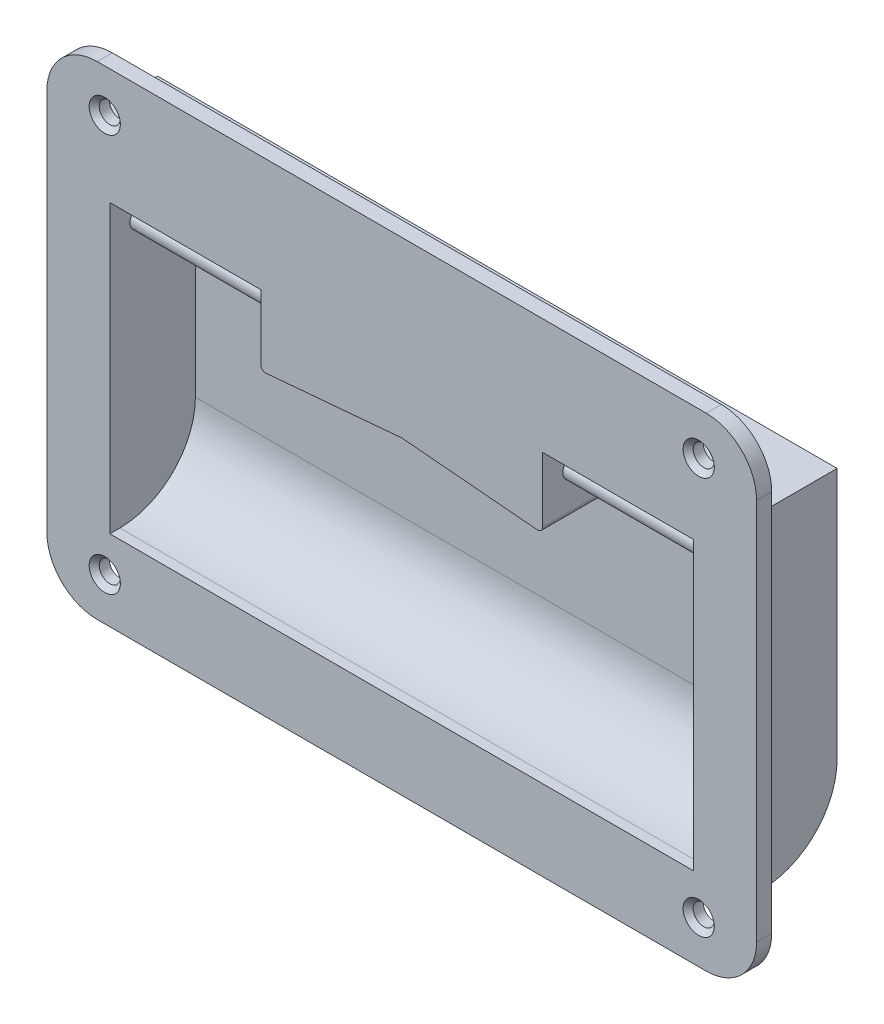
ISO-10303-21;
HEADER;
FILE_DESCRIPTION(('STEP AP214'),'2;1');
FILE_NAME('part.step','',(''),(''),'','','');
FILE_SCHEMA(('AUTOMOTIVE_DESIGN { 1 0 10303 214 1 1 1 1 }'));
ENDSEC;
DATA;
#1=APPLICATION_CONTEXT('core data for automotive mechanical design processes');
#2=APPLICATION_PROTOCOL_DEFINITION('international standard','automotive_design',2000,#1);
#3=PRODUCT_CONTEXT('',#1,'mechanical');
#4=PRODUCT('Part','Part','',(#3));
#5=PRODUCT_RELATED_PRODUCT_CATEGORY('part','',(#4));
#6=PRODUCT_DEFINITION_FORMATION('','',#4);
#7=PRODUCT_DEFINITION_CONTEXT('part definition',#1,'design');
#8=PRODUCT_DEFINITION('design','',#6,#7);
#9=PRODUCT_DEFINITION_SHAPE('','',#8);
#10=(LENGTH_UNIT() NAMED_UNIT(*) SI_UNIT(.MILLI.,.METRE.));
#11=(NAMED_UNIT(*) PLANE_ANGLE_UNIT() SI_UNIT($,.RADIAN.));
#12=(NAMED_UNIT(*) SI_UNIT($,.STERADIAN.) SOLID_ANGLE_UNIT());
#13=UNCERTAINTY_MEASURE_WITH_UNIT(LENGTH_MEASURE(1.E-05),#10,'distance_accuracy_value','');
#14=(GEOMETRIC_REPRESENTATION_CONTEXT(3) GLOBAL_UNCERTAINTY_ASSIGNED_CONTEXT((#13)) GLOBAL_UNIT_ASSIGNED_CONTEXT((#10,
#11,#12)) REPRESENTATION_CONTEXT('',''));
#15=CARTESIAN_POINT('',(0.,0.,0.));
#16=DIRECTION('',(0.,0.,1.));
#17=DIRECTION('',(1.,0.,0.));
#18=AXIS2_PLACEMENT_3D('',#15,#16,#17);
#19=CARTESIAN_POINT('',(-11.5,77.5,3.));
#20=DIRECTION('',(1.,0.,0.));
#21=DIRECTION('',(0.,0.,-1.));
#22=AXIS2_PLACEMENT_3D('',#19,#20,#21);
#23=PLANE('',#22);
#24=DIRECTION('',(0.,-1.,0.));
#25=VECTOR('',#24,1.);
#26=CARTESIAN_POINT('',(-11.5,77.5,0.));
#27=LINE('',#26,#25);
#28=CARTESIAN_POINT('',(-11.5,77.5,0.));
#29=VERTEX_POINT('',#28);
#30=CARTESIAN_POINT('',(-11.5,1.5,0.));
#31=VERTEX_POINT('',#30);
#32=EDGE_CURVE('E361',#29,#31,#27,.T.);
#33=ORIENTED_EDGE('',*,*,#32,.T.);
#34=DIRECTION('',(0.,0.,-1.));
#35=VECTOR('',#34,1.);
#36=CARTESIAN_POINT('',(-11.5,1.5,3.));
#37=LINE('',#36,#35);
#38=CARTESIAN_POINT('',(-11.5,1.5,3.));
#39=VERTEX_POINT('',#38);
#40=EDGE_CURVE('E9',#39,#31,#37,.T.);
#41=ORIENTED_EDGE('',*,*,#40,.F.);
#42=DIRECTION('',(0.,-1.,0.));
#43=VECTOR('',#42,1.);
#44=CARTESIAN_POINT('',(-11.5,77.5,3.));
#45=LINE('',#44,#43);
#46=CARTESIAN_POINT('',(-11.5,77.5,3.));
#47=VERTEX_POINT('',#46);
#48=EDGE_CURVE('E362',#47,#39,#45,.T.);
#49=ORIENTED_EDGE('',*,*,#48,.F.);
#50=DIRECTION('',(0.,0.,-1.));
#51=VECTOR('',#50,1.);
#52=CARTESIAN_POINT('',(-11.5,77.5,3.));
#53=LINE('',#52,#51);
#54=EDGE_CURVE('E380',#47,#29,#53,.T.);
#55=ORIENTED_EDGE('',*,*,#54,.T.);
#56=EDGE_LOOP('',(#33,#41,#49,#55));
#57=FACE_BOUND('',#56,.T.);
#58=ADVANCED_FACE('F14',(#57),#23,.F.);
#59=CARTESIAN_POINT('',(-1.5,1.5,3.));
#60=DIRECTION('',(0.,0.,-1.));
#61=DIRECTION('',(-1.,0.,0.));
#62=AXIS2_PLACEMENT_3D('',#59,#60,#61);
#63=CYLINDRICAL_SURFACE('',#62,10.);
#64=CARTESIAN_POINT('',(-1.5,1.5,0.));
#65=DIRECTION('',(0.,0.,1.));
#66=DIRECTION('',(1.,0.,0.));
#67=AXIS2_PLACEMENT_3D('',#64,#65,#66);
#68=CIRCLE('',#67,10.);
#69=CARTESIAN_POINT('',(-1.5,-8.5,0.));
#70=VERTEX_POINT('',#69);
#71=EDGE_CURVE('E383',#31,#70,#68,.T.);
#72=ORIENTED_EDGE('',*,*,#71,.T.);
#73=DIRECTION('',(0.,0.,-1.));
#74=VECTOR('',#73,1.);
#75=CARTESIAN_POINT('',(-1.5,-8.5,3.));
#76=LINE('',#75,#74);
#77=CARTESIAN_POINT('',(-1.5,-8.5,3.));
#78=VERTEX_POINT('',#77);
#79=EDGE_CURVE('E22',#78,#70,#76,.T.);
#80=ORIENTED_EDGE('',*,*,#79,.F.);
#81=CARTESIAN_POINT('',(-1.5,1.5,3.));
#82=DIRECTION('',(0.,0.,1.));
#83=DIRECTION('',(1.,0.,0.));
#84=AXIS2_PLACEMENT_3D('',#81,#82,#83);
#85=CIRCLE('',#84,10.);
#86=EDGE_CURVE('E365',#39,#78,#85,.T.);
#87=ORIENTED_EDGE('',*,*,#86,.F.);
#88=ORIENTED_EDGE('',*,*,#40,.T.);
#89=EDGE_LOOP('',(#72,#80,#87,#88));
#90=FACE_BOUND('',#89,.T.);
#91=ADVANCED_FACE('F440',(#90),#63,.T.);
#92=CARTESIAN_POINT('',(-1.5,-8.5,3.));
#93=DIRECTION('',(0.,1.,0.));
#94=DIRECTION('',(0.,0.,1.));
#95=AXIS2_PLACEMENT_3D('',#92,#93,#94);
#96=PLANE('',#95);
#97=DIRECTION('',(1.,0.,0.));
#98=VECTOR('',#97,1.);
#99=CARTESIAN_POINT('',(-1.5,-8.5,0.));
#100=LINE('',#99,#98);
#101=CARTESIAN_POINT('',(119.5,-8.5,0.));
#102=VERTEX_POINT('',#101);
#103=EDGE_CURVE('E385',#70,#102,#100,.T.);
#104=ORIENTED_EDGE('',*,*,#103,.T.);
#105=DIRECTION('',(0.,0.,-1.));
#106=VECTOR('',#105,1.);
#107=CARTESIAN_POINT('',(119.5,-8.5,3.));
#108=LINE('',#107,#106);
#109=CARTESIAN_POINT('',(119.5,-8.5,3.));
#110=VERTEX_POINT('',#109);
#111=EDGE_CURVE('E410',#110,#102,#108,.T.);
#112=ORIENTED_EDGE('',*,*,#111,.F.);
#113=DIRECTION('',(1.,0.,0.));
#114=VECTOR('',#113,1.);
#115=CARTESIAN_POINT('',(-1.5,-8.5,3.));
#116=LINE('',#115,#114);
#117=EDGE_CURVE('E368',#78,#110,#116,.T.);
#118=ORIENTED_EDGE('',*,*,#117,.F.);
#119=ORIENTED_EDGE('',*,*,#79,.T.);
#120=EDGE_LOOP('',(#104,#112,#118,#119));
#121=FACE_BOUND('',#120,.T.);
#122=ADVANCED_FACE('F418',(#121),#96,.F.);
#123=CARTESIAN_POINT('',(119.5,1.5,3.));
#124=DIRECTION('',(0.,0.,-1.));
#125=DIRECTION('',(-1.,0.,0.));
#126=AXIS2_PLACEMENT_3D('',#123,#124,#125);
#127=CYLINDRICAL_SURFACE('',#126,10.);
#128=CARTESIAN_POINT('',(119.5,1.5,0.));
#129=DIRECTION('',(0.,0.,1.));
#130=DIRECTION('',(1.,0.,0.));
#131=AXIS2_PLACEMENT_3D('',#128,#129,#130);
#132=CIRCLE('',#131,10.);
#133=CARTESIAN_POINT('',(129.5,1.5,0.));
#134=VERTEX_POINT('',#133);
#135=EDGE_CURVE('E387',#102,#134,#132,.T.);
#136=ORIENTED_EDGE('',*,*,#135,.T.);
#137=DIRECTION('',(0.,0.,-1.));
#138=VECTOR('',#137,1.);
#139=CARTESIAN_POINT('',(129.5,1.5,3.));
#140=LINE('',#139,#138);
#141=CARTESIAN_POINT('',(129.5,1.5,3.));
#142=VERTEX_POINT('',#141);
#143=EDGE_CURVE('E407',#142,#134,#140,.T.);
#144=ORIENTED_EDGE('',*,*,#143,.F.);
#145=CARTESIAN_POINT('',(119.5,1.5,3.));
#146=DIRECTION('',(0.,0.,1.));
#147=DIRECTION('',(1.,0.,0.));
#148=AXIS2_PLACEMENT_3D('',#145,#146,#147);
#149=CIRCLE('',#148,10.);
#150=EDGE_CURVE('E370',#110,#142,#149,.T.);
#151=ORIENTED_EDGE('',*,*,#150,.F.);
#152=ORIENTED_EDGE('',*,*,#111,.T.);
#153=EDGE_LOOP('',(#136,#144,#151,#152));
#154=FACE_BOUND('',#153,.T.);
#155=ADVANCED_FACE('F429',(#154),#127,.T.);
#156=CARTESIAN_POINT('',(129.5,1.5,3.));
#157=DIRECTION('',(-1.,0.,0.));
#158=DIRECTION('',(0.,0.,1.));
#159=AXIS2_PLACEMENT_3D('',#156,#157,#158);
#160=PLANE('',#159);
#161=DIRECTION('',(0.,1.,0.));
#162=VECTOR('',#161,1.);
#163=CARTESIAN_POINT('',(129.5,1.5,0.));
#164=LINE('',#163,#162);
#165=CARTESIAN_POINT('',(129.5,77.5,0.));
#166=VERTEX_POINT('',#165);
#167=EDGE_CURVE('E389',#134,#166,#164,.T.);
#168=ORIENTED_EDGE('',*,*,#167,.T.);
#169=DIRECTION('',(0.,0.,-1.));
#170=VECTOR('',#169,1.);
#171=CARTESIAN_POINT('',(129.5,77.5,3.));
#172=LINE('',#171,#170);
#173=CARTESIAN_POINT('',(129.5,77.5,3.));
#174=VERTEX_POINT('',#173);
#175=EDGE_CURVE('E404',#174,#166,#172,.T.);
#176=ORIENTED_EDGE('',*,*,#175,.F.);
#177=DIRECTION('',(0.,1.,0.));
#178=VECTOR('',#177,1.);
#179=CARTESIAN_POINT('',(129.5,1.5,3.));
#180=LINE('',#179,#178);
#181=EDGE_CURVE('E372',#142,#174,#180,.T.);
#182=ORIENTED_EDGE('',*,*,#181,.F.);
#183=ORIENTED_EDGE('',*,*,#143,.T.);
#184=EDGE_LOOP('',(#168,#176,#182,#183));
#185=FACE_BOUND('',#184,.T.);
#186=ADVANCED_FACE('F433',(#185),#160,.F.);
#187=CARTESIAN_POINT('',(119.5,77.5,3.));
#188=DIRECTION('',(0.,0.,-1.));
#189=DIRECTION('',(-1.,0.,0.));
#190=AXIS2_PLACEMENT_3D('',#187,#188,#189);
#191=CYLINDRICAL_SURFACE('',#190,10.);
#192=CARTESIAN_POINT('',(119.5,77.5,0.));
#193=DIRECTION('',(0.,0.,1.));
#194=DIRECTION('',(1.,0.,0.));
#195=AXIS2_PLACEMENT_3D('',#192,#193,#194);
#196=CIRCLE('',#195,10.);
#197=CARTESIAN_POINT('',(119.5,87.5,0.));
#198=VERTEX_POINT('',#197);
#199=EDGE_CURVE('E391',#166,#198,#196,.T.);
#200=ORIENTED_EDGE('',*,*,#199,.T.);
#201=DIRECTION('',(0.,0.,-1.));
#202=VECTOR('',#201,1.);
#203=CARTESIAN_POINT('',(119.5,87.5,3.));
#204=LINE('',#203,#202);
#205=CARTESIAN_POINT('',(119.5,87.5,3.));
#206=VERTEX_POINT('',#205);
#207=EDGE_CURVE('E401',#206,#198,#204,.T.);
#208=ORIENTED_EDGE('',*,*,#207,.F.);
#209=CARTESIAN_POINT('',(119.5,77.5,3.));
#210=DIRECTION('',(0.,0.,1.));
#211=DIRECTION('',(1.,0.,0.));
#212=AXIS2_PLACEMENT_3D('',#209,#210,#211);
#213=CIRCLE('',#212,10.);
#214=EDGE_CURVE('E374',#174,#206,#213,.T.);
#215=ORIENTED_EDGE('',*,*,#214,.F.);
#216=ORIENTED_EDGE('',*,*,#175,.T.);
#217=EDGE_LOOP('',(#200,#208,#215,#216));
#218=FACE_BOUND('',#217,.T.);
#219=ADVANCED_FACE('F453',(#218),#191,.T.);
#220=CARTESIAN_POINT('',(119.5,87.5,3.));
#221=DIRECTION('',(0.,-1.,0.));
#222=DIRECTION('',(0.,0.,-1.));
#223=AXIS2_PLACEMENT_3D('',#220,#221,#222);
#224=PLANE('',#223);
#225=DIRECTION('',(-1.,0.,0.));
#226=VECTOR('',#225,1.);
#227=CARTESIAN_POINT('',(119.5,87.5,0.));
#228=LINE('',#227,#226);
#229=CARTESIAN_POINT('',(-1.5,87.5,0.));
#230=VERTEX_POINT('',#229);
#231=EDGE_CURVE('E393',#198,#230,#228,.T.);
#232=ORIENTED_EDGE('',*,*,#231,.T.);
#233=DIRECTION('',(0.,0.,-1.));
#234=VECTOR('',#233,1.);
#235=CARTESIAN_POINT('',(-1.5,87.5,3.));
#236=LINE('',#235,#234);
#237=CARTESIAN_POINT('',(-1.5,87.5,3.));
#238=VERTEX_POINT('',#237);
#239=EDGE_CURVE('E398',#238,#230,#236,.T.);
#240=ORIENTED_EDGE('',*,*,#239,.F.);
#241=DIRECTION('',(-1.,0.,0.));
#242=VECTOR('',#241,1.);
#243=CARTESIAN_POINT('',(119.5,87.5,3.));
#244=LINE('',#243,#242);
#245=EDGE_CURVE('E376',#206,#238,#244,.T.);
#246=ORIENTED_EDGE('',*,*,#245,.F.);
#247=ORIENTED_EDGE('',*,*,#207,.T.);
#248=EDGE_LOOP('',(#232,#240,#246,#247));
#249=FACE_BOUND('',#248,.T.);
#250=ADVANCED_FACE('F451',(#249),#224,.F.);
#251=CARTESIAN_POINT('',(-1.5,77.5,3.));
#252=DIRECTION('',(0.,0.,-1.));
#253=DIRECTION('',(-1.,0.,0.));
#254=AXIS2_PLACEMENT_3D('',#251,#252,#253);
#255=CYLINDRICAL_SURFACE('',#254,10.);
#256=CARTESIAN_POINT('',(-1.5,77.5,0.));
#257=DIRECTION('',(0.,0.,1.));
#258=DIRECTION('',(1.,0.,0.));
#259=AXIS2_PLACEMENT_3D('',#256,#257,#258);
#260=CIRCLE('',#259,10.);
#261=EDGE_CURVE('E366',#230,#29,#260,.T.);
#262=ORIENTED_EDGE('',*,*,#261,.T.);
#263=ORIENTED_EDGE('',*,*,#54,.F.);
#264=CARTESIAN_POINT('',(-1.5,77.5,3.));
#265=DIRECTION('',(0.,0.,1.));
#266=DIRECTION('',(1.,0.,0.));
#267=AXIS2_PLACEMENT_3D('',#264,#265,#266);
#268=CIRCLE('',#267,10.);
#269=EDGE_CURVE('E378',#238,#47,#268,.T.);
#270=ORIENTED_EDGE('',*,*,#269,.F.);
#271=ORIENTED_EDGE('',*,*,#239,.T.);
#272=EDGE_LOOP('',(#262,#263,#270,#271));
#273=FACE_BOUND('',#272,.T.);
#274=ADVANCED_FACE('F446',(#273),#255,.T.);
#275=CARTESIAN_POINT('',(-1.5,1.5,3.));
#276=DIRECTION('',(0.,0.,1.));
#277=DIRECTION('',(1.,0.,0.));
#278=AXIS2_PLACEMENT_3D('',#275,#276,#277);
#279=PLANE('',#278);
#280=DIRECTION('',(0.,1.,0.));
#281=VECTOR('',#280,1.);
#282=CARTESIAN_POINT('',(117.,24.,3.));
#283=LINE('',#282,#281);
#284=CARTESIAN_POINT('',(117.,7.5,3.));
#285=VERTEX_POINT('',#284);
#286=CARTESIAN_POINT('',(117.,64.5,3.));
#287=VERTEX_POINT('',#286);
#288=EDGE_CURVE('E182',#285,#287,#283,.T.);
#289=ORIENTED_EDGE('',*,*,#288,.F.);
#290=DIRECTION('',(-1.,0.,0.));
#291=VECTOR('',#290,1.);
#292=CARTESIAN_POINT('',(117.,7.5,3.));
#293=LINE('',#292,#291);
#294=CARTESIAN_POINT('',(1.,7.5,3.));
#295=VERTEX_POINT('',#294);
#296=EDGE_CURVE('E187',#285,#295,#293,.T.);
#297=ORIENTED_EDGE('',*,*,#296,.T.);
#298=DIRECTION('',(0.,-1.,0.));
#299=VECTOR('',#298,1.);
#300=CARTESIAN_POINT('',(1.,64.5,3.));
#301=LINE('',#300,#299);
#302=CARTESIAN_POINT('',(1.,64.5,3.));
#303=VERTEX_POINT('',#302);
#304=EDGE_CURVE('E193',#303,#295,#301,.T.);
#305=ORIENTED_EDGE('',*,*,#304,.F.);
#306=DIRECTION('',(-1.,0.,0.));
#307=VECTOR('',#306,1.);
#308=CARTESIAN_POINT('',(31.,64.5,3.));
#309=LINE('',#308,#307);
#310=CARTESIAN_POINT('',(31.,64.5,3.));
#311=VERTEX_POINT('',#310);
#312=EDGE_CURVE('E225',#311,#303,#309,.T.);
#313=ORIENTED_EDGE('',*,*,#312,.F.);
#314=DIRECTION('',(0.,1.,0.));
#315=VECTOR('',#314,1.);
#316=CARTESIAN_POINT('',(31.,51.6416259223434,3.));
#317=LINE('',#316,#315);
#318=CARTESIAN_POINT('',(31.,51.6416259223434,3.));
#319=VERTEX_POINT('',#318);
#320=EDGE_CURVE('E29',#319,#311,#317,.T.);
#321=ORIENTED_EDGE('',*,*,#320,.F.);
#322=CARTESIAN_POINT('',(32.,51.6416259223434,3.));
#323=DIRECTION('',(0.,0.,1.));
#324=DIRECTION('',(1.,0.,0.));
#325=AXIS2_PLACEMENT_3D('',#322,#323,#324);
#326=CIRCLE('',#325,1.);
#327=CARTESIAN_POINT('',(32.0871557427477,50.6454312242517,3.));
#328=VERTEX_POINT('',#327);
#329=EDGE_CURVE('E267',#319,#328,#326,.T.);
#330=ORIENTED_EDGE('',*,*,#329,.T.);
#331=DIRECTION('',(-0.996194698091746,-0.0871557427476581,0.));
#332=VECTOR('',#331,1.);
#333=CARTESIAN_POINT('',(59.,53.,3.));
#334=LINE('',#333,#332);
#335=CARTESIAN_POINT('',(59.,53.,3.));
#336=VERTEX_POINT('',#335);
#337=EDGE_CURVE('E264',#336,#328,#334,.T.);
#338=ORIENTED_EDGE('',*,*,#337,.F.);
#339=DIRECTION('',(-0.996194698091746,0.0871557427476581,0.));
#340=VECTOR('',#339,1.);
#341=CARTESIAN_POINT('',(85.9128442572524,50.6454312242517,3.));
#342=LINE('',#341,#340);
#343=CARTESIAN_POINT('',(85.9128442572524,50.6454312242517,3.));
#344=VERTEX_POINT('',#343);
#345=EDGE_CURVE('E261',#344,#336,#342,.T.);
#346=ORIENTED_EDGE('',*,*,#345,.F.);
#347=CARTESIAN_POINT('',(86.,51.6416259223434,3.));
#348=DIRECTION('',(0.,0.,1.));
#349=DIRECTION('',(1.,0.,0.));
#350=AXIS2_PLACEMENT_3D('',#347,#348,#349);
#351=CIRCLE('',#350,1.);
#352=CARTESIAN_POINT('',(87.,51.6416259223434,3.));
#353=VERTEX_POINT('',#352);
#354=EDGE_CURVE('E258',#344,#353,#351,.T.);
#355=ORIENTED_EDGE('',*,*,#354,.T.);
#356=DIRECTION('',(0.,-1.,0.));
#357=VECTOR('',#356,1.);
#358=CARTESIAN_POINT('',(87.,64.5,3.));
#359=LINE('',#358,#357);
#360=CARTESIAN_POINT('',(87.,64.5,3.));
#361=VERTEX_POINT('',#360);
#362=EDGE_CURVE('E255',#361,#353,#359,.T.);
#363=ORIENTED_EDGE('',*,*,#362,.F.);
#364=DIRECTION('',(-1.,0.,0.));
#365=VECTOR('',#364,1.);
#366=CARTESIAN_POINT('',(117.,64.5,3.));
#367=LINE('',#366,#365);
#368=EDGE_CURVE('E190',#287,#361,#367,.T.);
#369=ORIENTED_EDGE('',*,*,#368,.F.);
#370=EDGE_LOOP('',(#289,#297,#305,#313,#321,#330,#338,#346,#355,#363,#369));
#371=FACE_BOUND('',#370,.T.);
#372=CARTESIAN_POINT('',(0.,0.,3.));
#373=DIRECTION('',(0.,0.,-1.));
#374=DIRECTION('',(-1.,0.,0.));
#375=AXIS2_PLACEMENT_3D('',#372,#373,#374);
#376=CIRCLE('',#375,3.1);
#377=CARTESIAN_POINT('',(-3.1,0.,3.));
#378=VERTEX_POINT('',#377);
#379=EDGE_CURVE('E296',#378,#378,#376,.T.);
#380=ORIENTED_EDGE('',*,*,#379,.T.);
#381=EDGE_LOOP('',(#380));
#382=FACE_BOUND('',#381,.T.);
#383=CARTESIAN_POINT('',(0.,79.,3.));
#384=DIRECTION('',(0.,0.,-1.));
#385=DIRECTION('',(-1.,0.,0.));
#386=AXIS2_PLACEMENT_3D('',#383,#384,#385);
#387=CIRCLE('',#386,3.1);
#388=CARTESIAN_POINT('',(-3.1,79.,3.));
#389=VERTEX_POINT('',#388);
#390=EDGE_CURVE('E305',#389,#389,#387,.T.);
#391=ORIENTED_EDGE('',*,*,#390,.T.);
#392=EDGE_LOOP('',(#391));
#393=FACE_BOUND('',#392,.T.);
#394=CARTESIAN_POINT('',(118.,0.,3.));
#395=DIRECTION('',(0.,0.,-1.));
#396=DIRECTION('',(-1.,0.,0.));
#397=AXIS2_PLACEMENT_3D('',#394,#395,#396);
#398=CIRCLE('',#397,3.1);
#399=CARTESIAN_POINT('',(114.9,0.,3.));
#400=VERTEX_POINT('',#399);
#401=EDGE_CURVE('E314',#400,#400,#398,.T.);
#402=ORIENTED_EDGE('',*,*,#401,.T.);
#403=EDGE_LOOP('',(#402));
#404=FACE_BOUND('',#403,.T.);
#405=CARTESIAN_POINT('',(118.,79.,3.));
#406=DIRECTION('',(0.,0.,-1.));
#407=DIRECTION('',(-1.,0.,0.));
#408=AXIS2_PLACEMENT_3D('',#405,#406,#407);
#409=CIRCLE('',#408,3.1);
#410=CARTESIAN_POINT('',(114.9,79.,3.));
#411=VERTEX_POINT('',#410);
#412=EDGE_CURVE('E323',#411,#411,#409,.T.);
#413=ORIENTED_EDGE('',*,*,#412,.T.);
#414=EDGE_LOOP('',(#413));
#415=FACE_BOUND('',#414,.T.);
#416=ORIENTED_EDGE('',*,*,#48,.T.);
#417=ORIENTED_EDGE('',*,*,#86,.T.);
#418=ORIENTED_EDGE('',*,*,#117,.T.);
#419=ORIENTED_EDGE('',*,*,#150,.T.);
#420=ORIENTED_EDGE('',*,*,#181,.T.);
#421=ORIENTED_EDGE('',*,*,#214,.T.);
#422=ORIENTED_EDGE('',*,*,#245,.T.);
#423=ORIENTED_EDGE('',*,*,#269,.T.);
#424=EDGE_LOOP('',(#416,#417,#418,#419,#420,#421,#422,#423));
#425=FACE_BOUND('',#424,.T.);
#426=ADVANCED_FACE('F184',(#371,#382,#393,#404,#415,#425),#279,.T.);
#427=CARTESIAN_POINT('',(-1.5,1.5,0.));
#428=DIRECTION('',(0.,0.,1.));
#429=DIRECTION('',(1.,0.,0.));
#430=AXIS2_PLACEMENT_3D('',#427,#428,#429);
#431=PLANE('',#430);
#432=CARTESIAN_POINT('',(0.,0.,0.));
#433=DIRECTION('',(0.,0.,-1.));
#434=DIRECTION('',(-1.,0.,0.));
#435=AXIS2_PLACEMENT_3D('',#432,#433,#434);
#436=CIRCLE('',#435,2.1);
#437=CARTESIAN_POINT('',(-2.1,0.,0.));
#438=VERTEX_POINT('',#437);
#439=EDGE_CURVE('E290',#438,#438,#436,.T.);
#440=ORIENTED_EDGE('',*,*,#439,.F.);
#441=EDGE_LOOP('',(#440));
#442=FACE_BOUND('',#441,.T.);
#443=CARTESIAN_POINT('',(0.,79.,0.));
#444=DIRECTION('',(0.,0.,-1.));
#445=DIRECTION('',(-1.,0.,0.));
#446=AXIS2_PLACEMENT_3D('',#443,#444,#445);
#447=CIRCLE('',#446,2.1);
#448=CARTESIAN_POINT('',(-2.1,79.,0.));
#449=VERTEX_POINT('',#448);
#450=EDGE_CURVE('E299',#449,#449,#447,.T.);
#451=ORIENTED_EDGE('',*,*,#450,.F.);
#452=EDGE_LOOP('',(#451));
#453=FACE_BOUND('',#452,.T.);
#454=CARTESIAN_POINT('',(118.,0.,0.));
#455=DIRECTION('',(0.,0.,-1.));
#456=DIRECTION('',(-1.,0.,0.));
#457=AXIS2_PLACEMENT_3D('',#454,#455,#456);
#458=CIRCLE('',#457,2.1);
#459=CARTESIAN_POINT('',(115.9,0.,0.));
#460=VERTEX_POINT('',#459);
#461=EDGE_CURVE('E308',#460,#460,#458,.T.);
#462=ORIENTED_EDGE('',*,*,#461,.F.);
#463=EDGE_LOOP('',(#462));
#464=FACE_BOUND('',#463,.T.);
#465=CARTESIAN_POINT('',(118.,79.,0.));
#466=DIRECTION('',(0.,0.,-1.));
#467=DIRECTION('',(-1.,0.,0.));
#468=AXIS2_PLACEMENT_3D('',#465,#466,#467);
#469=CIRCLE('',#468,2.1);
#470=CARTESIAN_POINT('',(115.9,79.,0.));
#471=VERTEX_POINT('',#470);
#472=EDGE_CURVE('E317',#471,#471,#469,.T.);
#473=ORIENTED_EDGE('',*,*,#472,.F.);
#474=EDGE_LOOP('',(#473));
#475=FACE_BOUND('',#474,.T.);
#476=DIRECTION('',(-1.,0.,0.));
#477=VECTOR('',#476,1.);
#478=CARTESIAN_POINT('',(126.5,7.,0.));
#479=LINE('',#478,#477);
#480=CARTESIAN_POINT('',(126.5,7.,0.));
#481=VERTEX_POINT('',#480);
#482=CARTESIAN_POINT('',(-8.5,7.,0.));
#483=VERTEX_POINT('',#482);
#484=EDGE_CURVE('E37',#481,#483,#479,.T.);
#485=ORIENTED_EDGE('',*,*,#484,.F.);
#486=DIRECTION('',(0.,-1.,0.));
#487=VECTOR('',#486,1.);
#488=CARTESIAN_POINT('',(126.5,72.,0.));
#489=LINE('',#488,#487);
#490=CARTESIAN_POINT('',(126.5,72.,0.));
#491=VERTEX_POINT('',#490);
#492=EDGE_CURVE('E327',#491,#481,#489,.T.);
#493=ORIENTED_EDGE('',*,*,#492,.F.);
#494=DIRECTION('',(-1.,0.,0.));
#495=VECTOR('',#494,1.);
#496=CARTESIAN_POINT('',(126.5,72.,0.));
#497=LINE('',#496,#495);
#498=CARTESIAN_POINT('',(-8.5,72.,0.));
#499=VERTEX_POINT('',#498);
#500=EDGE_CURVE('E340',#491,#499,#497,.T.);
#501=ORIENTED_EDGE('',*,*,#500,.T.);
#502=DIRECTION('',(0.,-1.,0.));
#503=VECTOR('',#502,1.);
#504=CARTESIAN_POINT('',(-8.5,72.,0.));
#505=LINE('',#504,#503);
#506=EDGE_CURVE('E326',#499,#483,#505,.T.);
#507=ORIENTED_EDGE('',*,*,#506,.T.);
#508=EDGE_LOOP('',(#485,#493,#501,#507));
#509=FACE_BOUND('',#508,.T.);
#510=ORIENTED_EDGE('',*,*,#32,.F.);
#511=ORIENTED_EDGE('',*,*,#261,.F.);
#512=ORIENTED_EDGE('',*,*,#231,.F.);
#513=ORIENTED_EDGE('',*,*,#199,.F.);
#514=ORIENTED_EDGE('',*,*,#167,.F.);
#515=ORIENTED_EDGE('',*,*,#135,.F.);
#516=ORIENTED_EDGE('',*,*,#103,.F.);
#517=ORIENTED_EDGE('',*,*,#71,.F.);
#518=EDGE_LOOP('',(#510,#511,#512,#513,#514,#515,#516,#517));
#519=FACE_BOUND('',#518,.T.);
#520=ADVANCED_FACE('F424',(#442,#453,#464,#475,#509,#519),#431,.F.);
#521=CARTESIAN_POINT('',(126.5,7.,0.));
#522=DIRECTION('',(0.,1.,0.));
#523=DIRECTION('',(0.,0.,1.));
#524=AXIS2_PLACEMENT_3D('',#521,#522,#523);
#525=PLANE('',#524);
#526=DIRECTION('',(0.,0.,-1.));
#527=VECTOR('',#526,1.);
#528=CARTESIAN_POINT('',(-8.5,7.,0.));
#529=LINE('',#528,#527);
#530=CARTESIAN_POINT('',(-8.5,7.,-1.));
#531=VERTEX_POINT('',#530);
#532=EDGE_CURVE('E342',#483,#531,#529,.T.);
#533=ORIENTED_EDGE('',*,*,#532,.T.);
#534=DIRECTION('',(-1.,0.,0.));
#535=VECTOR('',#534,1.);
#536=CARTESIAN_POINT('',(126.5,7.,-1.));
#537=LINE('',#536,#535);
#538=CARTESIAN_POINT('',(126.5,7.,-1.));
#539=VERTEX_POINT('',#538);
#540=EDGE_CURVE('E357',#539,#531,#537,.T.);
#541=ORIENTED_EDGE('',*,*,#540,.F.);
#542=DIRECTION('',(0.,0.,-1.));
#543=VECTOR('',#542,1.);
#544=CARTESIAN_POINT('',(126.5,7.,0.));
#545=LINE('',#544,#543);
#546=EDGE_CURVE('E330',#481,#539,#545,.T.);
#547=ORIENTED_EDGE('',*,*,#546,.F.);
#548=ORIENTED_EDGE('',*,*,#484,.T.);
#549=EDGE_LOOP('',(#533,#541,#547,#548));
#550=FACE_BOUND('',#549,.T.);
#551=ADVANCED_FACE('F535',(#550),#525,.F.);
#552=CARTESIAN_POINT('',(126.5,22.,-1.));
#553=DIRECTION('',(-1.,0.,0.));
#554=DIRECTION('',(0.,0.,1.));
#555=AXIS2_PLACEMENT_3D('',#552,#553,#554);
#556=CYLINDRICAL_SURFACE('',#555,15.);
#557=CARTESIAN_POINT('',(-8.5,22.,-1.));
#558=DIRECTION('',(1.,0.,0.));
#559=DIRECTION('',(0.,0.,-1.));
#560=AXIS2_PLACEMENT_3D('',#557,#558,#559);
#561=CIRCLE('',#560,15.);
#562=CARTESIAN_POINT('',(-8.5,22.,-16.));
#563=VERTEX_POINT('',#562);
#564=EDGE_CURVE('E344',#531,#563,#561,.T.);
#565=ORIENTED_EDGE('',*,*,#564,.T.);
#566=DIRECTION('',(-1.,0.,0.));
#567=VECTOR('',#566,1.);
#568=CARTESIAN_POINT('',(126.5,22.,-16.));
#569=LINE('',#568,#567);
#570=CARTESIAN_POINT('',(126.5,22.,-16.));
#571=VERTEX_POINT('',#570);
#572=EDGE_CURVE('E354',#571,#563,#569,.T.);
#573=ORIENTED_EDGE('',*,*,#572,.F.);
#574=CARTESIAN_POINT('',(126.5,22.,-1.));
#575=DIRECTION('',(1.,0.,0.));
#576=DIRECTION('',(0.,0.,-1.));
#577=AXIS2_PLACEMENT_3D('',#574,#575,#576);
#578=CIRCLE('',#577,15.);
#579=EDGE_CURVE('E333',#539,#571,#578,.T.);
#580=ORIENTED_EDGE('',*,*,#579,.F.);
#581=ORIENTED_EDGE('',*,*,#540,.T.);
#582=EDGE_LOOP('',(#565,#573,#580,#581));
#583=FACE_BOUND('',#582,.T.);
#584=ADVANCED_FACE('F544',(#583),#556,.T.);
#585=CARTESIAN_POINT('',(126.5,22.,-16.));
#586=DIRECTION('',(0.,0.,1.));
#587=DIRECTION('',(1.,0.,0.));
#588=AXIS2_PLACEMENT_3D('',#585,#586,#587);
#589=PLANE('',#588);
#590=DIRECTION('',(0.,1.,0.));
#591=VECTOR('',#590,1.);
#592=CARTESIAN_POINT('',(-8.5,22.,-16.));
#593=LINE('',#592,#591);
#594=CARTESIAN_POINT('',(-8.5,72.,-16.));
#595=VERTEX_POINT('',#594);
#596=EDGE_CURVE('E346',#563,#595,#593,.T.);
#597=ORIENTED_EDGE('',*,*,#596,.T.);
#598=DIRECTION('',(-1.,0.,0.));
#599=VECTOR('',#598,1.);
#600=CARTESIAN_POINT('',(126.5,72.,-16.));
#601=LINE('',#600,#599);
#602=CARTESIAN_POINT('',(126.5,72.,-16.));
#603=VERTEX_POINT('',#602);
#604=EDGE_CURVE('E351',#603,#595,#601,.T.);
#605=ORIENTED_EDGE('',*,*,#604,.F.);
#606=DIRECTION('',(0.,1.,0.));
#607=VECTOR('',#606,1.);
#608=CARTESIAN_POINT('',(126.5,22.,-16.));
#609=LINE('',#608,#607);
#610=EDGE_CURVE('E335',#571,#603,#609,.T.);
#611=ORIENTED_EDGE('',*,*,#610,.F.);
#612=ORIENTED_EDGE('',*,*,#572,.T.);
#613=EDGE_LOOP('',(#597,#605,#611,#612));
#614=FACE_BOUND('',#613,.T.);
#615=ADVANCED_FACE('F553',(#614),#589,.F.);
#616=CARTESIAN_POINT('',(126.5,72.,-16.));
#617=DIRECTION('',(0.,-1.,0.));
#618=DIRECTION('',(0.,0.,-1.));
#619=AXIS2_PLACEMENT_3D('',#616,#617,#618);
#620=PLANE('',#619);
#621=DIRECTION('',(0.,0.,1.));
#622=VECTOR('',#621,1.);
#623=CARTESIAN_POINT('',(-8.5,72.,-16.));
#624=LINE('',#623,#622);
#625=EDGE_CURVE('E331',#595,#499,#624,.T.);
#626=ORIENTED_EDGE('',*,*,#625,.T.);
#627=ORIENTED_EDGE('',*,*,#500,.F.);
#628=DIRECTION('',(0.,0.,1.));
#629=VECTOR('',#628,1.);
#630=CARTESIAN_POINT('',(126.5,72.,-16.));
#631=LINE('',#630,#629);
#632=EDGE_CURVE('E337',#603,#491,#631,.T.);
#633=ORIENTED_EDGE('',*,*,#632,.F.);
#634=ORIENTED_EDGE('',*,*,#604,.T.);
#635=EDGE_LOOP('',(#626,#627,#633,#634));
#636=FACE_BOUND('',#635,.T.);
#637=ADVANCED_FACE('F562',(#636),#620,.F.);
#638=CARTESIAN_POINT('',(126.5,22.,-1.));
#639=DIRECTION('',(1.,0.,0.));
#640=DIRECTION('',(0.,0.,-1.));
#641=AXIS2_PLACEMENT_3D('',#638,#639,#640);
#642=PLANE('',#641);
#643=ORIENTED_EDGE('',*,*,#492,.T.);
#644=ORIENTED_EDGE('',*,*,#546,.T.);
#645=ORIENTED_EDGE('',*,*,#579,.T.);
#646=ORIENTED_EDGE('',*,*,#610,.T.);
#647=ORIENTED_EDGE('',*,*,#632,.T.);
#648=EDGE_LOOP('',(#643,#644,#645,#646,#647));
#649=FACE_BOUND('',#648,.T.);
#650=ADVANCED_FACE('F571',(#649),#642,.T.);
#651=CARTESIAN_POINT('',(-8.5,22.,-1.));
#652=DIRECTION('',(1.,0.,0.));
#653=DIRECTION('',(0.,0.,-1.));
#654=AXIS2_PLACEMENT_3D('',#651,#652,#653);
#655=PLANE('',#654);
#656=ORIENTED_EDGE('',*,*,#506,.F.);
#657=ORIENTED_EDGE('',*,*,#625,.F.);
#658=ORIENTED_EDGE('',*,*,#596,.F.);
#659=ORIENTED_EDGE('',*,*,#564,.F.);
#660=ORIENTED_EDGE('',*,*,#532,.F.);
#661=EDGE_LOOP('',(#656,#657,#658,#659,#660));
#662=FACE_BOUND('',#661,.T.);
#663=ADVANCED_FACE('F580',(#662),#655,.F.);
#664=CARTESIAN_POINT('',(118.,79.,3.));
#665=DIRECTION('',(0.,0.,1.));
#666=DIRECTION('',(1.,0.,0.));
#667=AXIS2_PLACEMENT_3D('',#664,#665,#666);
#668=CONICAL_SURFACE('',#667,3.1,0.785398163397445);
#669=CARTESIAN_POINT('',(118.,79.,2.));
#670=DIRECTION('',(0.,0.,-1.));
#671=DIRECTION('',(-1.,0.,0.));
#672=AXIS2_PLACEMENT_3D('',#669,#670,#671);
#673=CIRCLE('',#672,2.1);
#674=CARTESIAN_POINT('',(115.9,79.,2.));
#675=VERTEX_POINT('',#674);
#676=EDGE_CURVE('E320',#675,#675,#673,.T.);
#677=ORIENTED_EDGE('',*,*,#676,.T.);
#678=EDGE_LOOP('',(#677));
#679=FACE_BOUND('',#678,.T.);
#680=ORIENTED_EDGE('',*,*,#412,.F.);
#681=EDGE_LOOP('',(#680));
#682=FACE_BOUND('',#681,.T.);
#683=ADVANCED_FACE('F589',(#679,#682),#668,.F.);
#684=CARTESIAN_POINT('',(118.,79.,0.));
#685=DIRECTION('',(0.,0.,-1.));
#686=DIRECTION('',(-1.,0.,0.));
#687=AXIS2_PLACEMENT_3D('',#684,#685,#686);
#688=CYLINDRICAL_SURFACE('',#687,2.1);
#689=ORIENTED_EDGE('',*,*,#472,.T.);
#690=EDGE_LOOP('',(#689));
#691=FACE_BOUND('',#690,.T.);
#692=ORIENTED_EDGE('',*,*,#676,.F.);
#693=EDGE_LOOP('',(#692));
#694=FACE_BOUND('',#693,.T.);
#695=ADVANCED_FACE('F598',(#691,#694),#688,.F.);
#696=CARTESIAN_POINT('',(118.,0.,3.));
#697=DIRECTION('',(0.,0.,1.));
#698=DIRECTION('',(1.,0.,0.));
#699=AXIS2_PLACEMENT_3D('',#696,#697,#698);
#700=CONICAL_SURFACE('',#699,3.1,0.785398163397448);
#701=CARTESIAN_POINT('',(118.,0.,2.));
#702=DIRECTION('',(0.,0.,-1.));
#703=DIRECTION('',(-1.,0.,0.));
#704=AXIS2_PLACEMENT_3D('',#701,#702,#703);
#705=CIRCLE('',#704,2.1);
#706=CARTESIAN_POINT('',(115.9,0.,2.));
#707=VERTEX_POINT('',#706);
#708=EDGE_CURVE('E311',#707,#707,#705,.T.);
#709=ORIENTED_EDGE('',*,*,#708,.T.);
#710=EDGE_LOOP('',(#709));
#711=FACE_BOUND('',#710,.T.);
#712=ORIENTED_EDGE('',*,*,#401,.F.);
#713=EDGE_LOOP('',(#712));
#714=FACE_BOUND('',#713,.T.);
#715=ADVANCED_FACE('F607',(#711,#714),#700,.F.);
#716=CARTESIAN_POINT('',(118.,0.,0.));
#717=DIRECTION('',(0.,0.,-1.));
#718=DIRECTION('',(-1.,0.,0.));
#719=AXIS2_PLACEMENT_3D('',#716,#717,#718);
#720=CYLINDRICAL_SURFACE('',#719,2.1);
#721=ORIENTED_EDGE('',*,*,#461,.T.);
#722=EDGE_LOOP('',(#721));
#723=FACE_BOUND('',#722,.T.);
#724=ORIENTED_EDGE('',*,*,#708,.F.);
#725=EDGE_LOOP('',(#724));
#726=FACE_BOUND('',#725,.T.);
#727=ADVANCED_FACE('F616',(#723,#726),#720,.F.);
#728=CARTESIAN_POINT('',(0.,79.,3.));
#729=DIRECTION('',(0.,0.,1.));
#730=DIRECTION('',(1.,0.,0.));
#731=AXIS2_PLACEMENT_3D('',#728,#729,#730);
#732=CONICAL_SURFACE('',#731,3.1,0.785398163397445);
#733=CARTESIAN_POINT('',(0.,79.,2.));
#734=DIRECTION('',(0.,0.,-1.));
#735=DIRECTION('',(-1.,0.,0.));
#736=AXIS2_PLACEMENT_3D('',#733,#734,#735);
#737=CIRCLE('',#736,2.1);
#738=CARTESIAN_POINT('',(-2.1,79.,2.));
#739=VERTEX_POINT('',#738);
#740=EDGE_CURVE('E302',#739,#739,#737,.T.);
#741=ORIENTED_EDGE('',*,*,#740,.T.);
#742=EDGE_LOOP('',(#741));
#743=FACE_BOUND('',#742,.T.);
#744=ORIENTED_EDGE('',*,*,#390,.F.);
#745=EDGE_LOOP('',(#744));
#746=FACE_BOUND('',#745,.T.);
#747=ADVANCED_FACE('F625',(#743,#746),#732,.F.);
#748=CARTESIAN_POINT('',(0.,79.,0.));
#749=DIRECTION('',(0.,0.,-1.));
#750=DIRECTION('',(-1.,0.,0.));
#751=AXIS2_PLACEMENT_3D('',#748,#749,#750);
#752=CYLINDRICAL_SURFACE('',#751,2.1);
#753=ORIENTED_EDGE('',*,*,#450,.T.);
#754=EDGE_LOOP('',(#753));
#755=FACE_BOUND('',#754,.T.);
#756=ORIENTED_EDGE('',*,*,#740,.F.);
#757=EDGE_LOOP('',(#756));
#758=FACE_BOUND('',#757,.T.);
#759=ADVANCED_FACE('F634',(#755,#758),#752,.F.);
#760=CARTESIAN_POINT('',(0.,0.,3.));
#761=DIRECTION('',(0.,0.,1.));
#762=DIRECTION('',(1.,0.,0.));
#763=AXIS2_PLACEMENT_3D('',#760,#761,#762);
#764=CONICAL_SURFACE('',#763,3.1,0.785398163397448);
#765=CARTESIAN_POINT('',(0.,0.,2.));
#766=DIRECTION('',(0.,0.,-1.));
#767=DIRECTION('',(-1.,0.,0.));
#768=AXIS2_PLACEMENT_3D('',#765,#766,#767);
#769=CIRCLE('',#768,2.1);
#770=CARTESIAN_POINT('',(-2.1,0.,2.));
#771=VERTEX_POINT('',#770);
#772=EDGE_CURVE('E293',#771,#771,#769,.T.);
#773=ORIENTED_EDGE('',*,*,#772,.T.);
#774=EDGE_LOOP('',(#773));
#775=FACE_BOUND('',#774,.T.);
#776=ORIENTED_EDGE('',*,*,#379,.F.);
#777=EDGE_LOOP('',(#776));
#778=FACE_BOUND('',#777,.T.);
#779=ADVANCED_FACE('F643',(#775,#778),#764,.F.);
#780=CARTESIAN_POINT('',(0.,0.,0.));
#781=DIRECTION('',(0.,0.,-1.));
#782=DIRECTION('',(-1.,0.,0.));
#783=AXIS2_PLACEMENT_3D('',#780,#781,#782);
#784=CYLINDRICAL_SURFACE('',#783,2.1);
#785=ORIENTED_EDGE('',*,*,#439,.T.);
#786=EDGE_LOOP('',(#785));
#787=FACE_BOUND('',#786,.T.);
#788=ORIENTED_EDGE('',*,*,#772,.F.);
#789=EDGE_LOOP('',(#788));
#790=FACE_BOUND('',#789,.T.);
#791=ADVANCED_FACE('F652',(#787,#790),#784,.F.);
#792=CARTESIAN_POINT('',(1.,64.5,-14.));
#793=DIRECTION('',(-1.,0.,0.));
#794=DIRECTION('',(0.,0.,1.));
#795=AXIS2_PLACEMENT_3D('',#792,#793,#794);
#796=PLANE('',#795);
#797=CARTESIAN_POINT('',(1.,59.,-3.));
#798=DIRECTION('',(-1.,0.,0.));
#799=DIRECTION('',(0.,0.,1.));
#800=AXIS2_PLACEMENT_3D('',#797,#798,#799);
#801=CIRCLE('',#800,2.);
#802=CARTESIAN_POINT('',(1.,59.,-1.));
#803=VERTEX_POINT('',#802);
#804=EDGE_CURVE('E215',#803,#803,#801,.T.);
#805=ORIENTED_EDGE('',*,*,#804,.T.);
#806=EDGE_LOOP('',(#805));
#807=FACE_BOUND('',#806,.T.);
#808=ORIENTED_EDGE('',*,*,#304,.T.);
#809=DIRECTION('',(0.,0.,-1.));
#810=VECTOR('',#809,1.);
#811=CARTESIAN_POINT('',(1.,7.5,3.));
#812=LINE('',#811,#810);
#813=CARTESIAN_POINT('',(1.,7.5,1.));
#814=VERTEX_POINT('',#813);
#815=EDGE_CURVE('E201',#295,#814,#812,.T.);
#816=ORIENTED_EDGE('',*,*,#815,.T.);
#817=CARTESIAN_POINT('',(1.,22.5,1.));
#818=DIRECTION('',(1.,0.,0.));
#819=DIRECTION('',(0.,0.,-1.));
#820=AXIS2_PLACEMENT_3D('',#817,#818,#819);
#821=CIRCLE('',#820,15.);
#822=CARTESIAN_POINT('',(1.,22.5,-14.));
#823=VERTEX_POINT('',#822);
#824=EDGE_CURVE('E208',#814,#823,#821,.T.);
#825=ORIENTED_EDGE('',*,*,#824,.T.);
#826=DIRECTION('',(0.,-1.,0.));
#827=VECTOR('',#826,1.);
#828=CARTESIAN_POINT('',(1.,64.5,-14.));
#829=LINE('',#828,#827);
#830=CARTESIAN_POINT('',(1.,64.5,-14.));
#831=VERTEX_POINT('',#830);
#832=EDGE_CURVE('E222',#831,#823,#829,.T.);
#833=ORIENTED_EDGE('',*,*,#832,.F.);
#834=DIRECTION('',(0.,0.,1.));
#835=VECTOR('',#834,1.);
#836=CARTESIAN_POINT('',(1.,64.5,-14.));
#837=LINE('',#836,#835);
#838=EDGE_CURVE('E252',#831,#303,#837,.T.);
#839=ORIENTED_EDGE('',*,*,#838,.T.);
#840=EDGE_LOOP('',(#808,#816,#825,#833,#839));
#841=FACE_BOUND('',#840,.T.);
#842=ADVANCED_FACE('F661',(#807,#841),#796,.F.);
#843=CARTESIAN_POINT('',(117.,24.,-14.));
#844=DIRECTION('',(1.,0.,0.));
#845=DIRECTION('',(0.,0.,-1.));
#846=AXIS2_PLACEMENT_3D('',#843,#844,#845);
#847=PLANE('',#846);
#848=CARTESIAN_POINT('',(117.,59.,-3.));
#849=DIRECTION('',(1.,0.,0.));
#850=DIRECTION('',(0.,0.,-1.));
#851=AXIS2_PLACEMENT_3D('',#848,#849,#850);
#852=CIRCLE('',#851,2.);
#853=CARTESIAN_POINT('',(117.,59.,-5.));
#854=VERTEX_POINT('',#853);
#855=EDGE_CURVE('E833',#854,#854,#852,.T.);
#856=ORIENTED_EDGE('',*,*,#855,.T.);
#857=EDGE_LOOP('',(#856));
#858=FACE_BOUND('',#857,.T.);
#859=ORIENTED_EDGE('',*,*,#288,.T.);
#860=DIRECTION('',(0.,0.,1.));
#861=VECTOR('',#860,1.);
#862=CARTESIAN_POINT('',(117.,64.5,-14.));
#863=LINE('',#862,#861);
#864=CARTESIAN_POINT('',(117.,64.5,-14.));
#865=VERTEX_POINT('',#864);
#866=EDGE_CURVE('E288',#865,#287,#863,.T.);
#867=ORIENTED_EDGE('',*,*,#866,.F.);
#868=DIRECTION('',(0.,1.,0.));
#869=VECTOR('',#868,1.);
#870=CARTESIAN_POINT('',(117.,24.,-14.));
#871=LINE('',#870,#869);
#872=CARTESIAN_POINT('',(117.,22.5,-14.));
#873=VERTEX_POINT('',#872);
#874=EDGE_CURVE('E224',#873,#865,#871,.T.);
#875=ORIENTED_EDGE('',*,*,#874,.F.);
#876=CARTESIAN_POINT('',(117.,22.5,1.));
#877=DIRECTION('',(1.,0.,0.));
#878=DIRECTION('',(0.,0.,-1.));
#879=AXIS2_PLACEMENT_3D('',#876,#877,#878);
#880=CIRCLE('',#879,15.);
#881=CARTESIAN_POINT('',(117.,7.5,1.));
#882=VERTEX_POINT('',#881);
#883=EDGE_CURVE('E207',#882,#873,#880,.T.);
#884=ORIENTED_EDGE('',*,*,#883,.F.);
#885=DIRECTION('',(0.,0.,-1.));
#886=VECTOR('',#885,1.);
#887=CARTESIAN_POINT('',(117.,7.5,3.));
#888=LINE('',#887,#886);
#889=EDGE_CURVE('E199',#285,#882,#888,.T.);
#890=ORIENTED_EDGE('',*,*,#889,.F.);
#891=EDGE_LOOP('',(#859,#867,#875,#884,#890));
#892=FACE_BOUND('',#891,.T.);
#893=ADVANCED_FACE('F205',(#858,#892),#847,.F.);
#894=CARTESIAN_POINT('',(117.,64.5,-14.));
#895=DIRECTION('',(0.,1.,0.));
#896=DIRECTION('',(0.,0.,1.));
#897=AXIS2_PLACEMENT_3D('',#894,#895,#896);
#898=PLANE('',#897);
#899=ORIENTED_EDGE('',*,*,#368,.T.);
#900=DIRECTION('',(0.,0.,1.));
#901=VECTOR('',#900,1.);
#902=CARTESIAN_POINT('',(87.,64.5,-14.));
#903=LINE('',#902,#901);
#904=CARTESIAN_POINT('',(87.,64.5,-14.));
#905=VERTEX_POINT('',#904);
#906=EDGE_CURVE('E286',#905,#361,#903,.T.);
#907=ORIENTED_EDGE('',*,*,#906,.F.);
#908=DIRECTION('',(-1.,0.,0.));
#909=VECTOR('',#908,1.);
#910=CARTESIAN_POINT('',(117.,64.5,-14.));
#911=LINE('',#910,#909);
#912=EDGE_CURVE('E228',#865,#905,#911,.T.);
#913=ORIENTED_EDGE('',*,*,#912,.F.);
#914=ORIENTED_EDGE('',*,*,#866,.T.);
#915=EDGE_LOOP('',(#899,#907,#913,#914));
#916=FACE_BOUND('',#915,.T.);
#917=ADVANCED_FACE('F678',(#916),#898,.F.);
#918=CARTESIAN_POINT('',(87.,64.5,-14.));
#919=DIRECTION('',(-1.,0.,0.));
#920=DIRECTION('',(0.,0.,1.));
#921=AXIS2_PLACEMENT_3D('',#918,#919,#920);
#922=PLANE('',#921);
#923=CARTESIAN_POINT('',(87.,59.,-3.));
#924=DIRECTION('',(-1.,0.,0.));
#925=DIRECTION('',(0.,0.,1.));
#926=AXIS2_PLACEMENT_3D('',#923,#924,#925);
#927=CIRCLE('',#926,2.);
#928=CARTESIAN_POINT('',(87.,59.,-1.));
#929=VERTEX_POINT('',#928);
#930=EDGE_CURVE('E830',#929,#929,#927,.T.);
#931=ORIENTED_EDGE('',*,*,#930,.T.);
#932=EDGE_LOOP('',(#931));
#933=FACE_BOUND('',#932,.T.);
#934=ORIENTED_EDGE('',*,*,#362,.T.);
#935=DIRECTION('',(0.,0.,1.));
#936=VECTOR('',#935,1.);
#937=CARTESIAN_POINT('',(87.,51.6416259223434,-14.));
#938=LINE('',#937,#936);
#939=CARTESIAN_POINT('',(87.,51.6416259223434,-14.));
#940=VERTEX_POINT('',#939);
#941=EDGE_CURVE('E284',#940,#353,#938,.T.);
#942=ORIENTED_EDGE('',*,*,#941,.F.);
#943=DIRECTION('',(0.,-1.,0.));
#944=VECTOR('',#943,1.);
#945=CARTESIAN_POINT('',(87.,64.5,-14.));
#946=LINE('',#945,#944);
#947=EDGE_CURVE('E231',#905,#940,#946,.T.);
#948=ORIENTED_EDGE('',*,*,#947,.F.);
#949=ORIENTED_EDGE('',*,*,#906,.T.);
#950=EDGE_LOOP('',(#934,#942,#948,#949));
#951=FACE_BOUND('',#950,.T.);
#952=ADVANCED_FACE('F687',(#933,#951),#922,.F.);
#953=CARTESIAN_POINT('',(86.,51.6416259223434,-14.));
#954=DIRECTION('',(0.,0.,1.));
#955=DIRECTION('',(1.,0.,0.));
#956=AXIS2_PLACEMENT_3D('',#953,#954,#955);
#957=CYLINDRICAL_SURFACE('',#956,1.);
#958=ORIENTED_EDGE('',*,*,#354,.F.);
#959=DIRECTION('',(0.,0.,1.));
#960=VECTOR('',#959,1.);
#961=CARTESIAN_POINT('',(85.9128442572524,50.6454312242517,-14.));
#962=LINE('',#961,#960);
#963=CARTESIAN_POINT('',(85.9128442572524,50.6454312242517,-14.));
#964=VERTEX_POINT('',#963);
#965=EDGE_CURVE('E282',#964,#344,#962,.T.);
#966=ORIENTED_EDGE('',*,*,#965,.F.);
#967=CARTESIAN_POINT('',(86.,51.6416259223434,-14.));
#968=DIRECTION('',(0.,0.,1.));
#969=DIRECTION('',(1.,0.,0.));
#970=AXIS2_PLACEMENT_3D('',#967,#968,#969);
#971=CIRCLE('',#970,1.);
#972=EDGE_CURVE('E234',#964,#940,#971,.T.);
#973=ORIENTED_EDGE('',*,*,#972,.T.);
#974=ORIENTED_EDGE('',*,*,#941,.T.);
#975=EDGE_LOOP('',(#958,#966,#973,#974));
#976=FACE_BOUND('',#975,.T.);
#977=ADVANCED_FACE('F696',(#976),#957,.T.);
#978=CARTESIAN_POINT('',(85.9128442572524,50.6454312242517,-14.));
#979=DIRECTION('',(0.0871557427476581,0.996194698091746,0.));
#980=DIRECTION('',(-0.996194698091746,0.0871557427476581,0.));
#981=AXIS2_PLACEMENT_3D('',#978,#979,#980);
#982=PLANE('',#981);
#983=ORIENTED_EDGE('',*,*,#345,.T.);
#984=DIRECTION('',(0.,0.,1.));
#985=VECTOR('',#984,1.);
#986=CARTESIAN_POINT('',(59.,53.,-14.));
#987=LINE('',#986,#985);
#988=CARTESIAN_POINT('',(59.,53.,-14.));
#989=VERTEX_POINT('',#988);
#990=EDGE_CURVE('E280',#989,#336,#987,.T.);
#991=ORIENTED_EDGE('',*,*,#990,.F.);
#992=DIRECTION('',(-0.996194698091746,0.0871557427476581,0.));
#993=VECTOR('',#992,1.);
#994=CARTESIAN_POINT('',(85.9128442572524,50.6454312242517,-14.));
#995=LINE('',#994,#993);
#996=EDGE_CURVE('E237',#964,#989,#995,.T.);
#997=ORIENTED_EDGE('',*,*,#996,.F.);
#998=ORIENTED_EDGE('',*,*,#965,.T.);
#999=EDGE_LOOP('',(#983,#991,#997,#998));
#1000=FACE_BOUND('',#999,.T.);
#1001=ADVANCED_FACE('F705',(#1000),#982,.F.);
#1002=CARTESIAN_POINT('',(59.,53.,-14.));
#1003=DIRECTION('',(-0.0871557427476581,0.996194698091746,0.));
#1004=DIRECTION('',(-0.996194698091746,-0.0871557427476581,0.));
#1005=AXIS2_PLACEMENT_3D('',#1002,#1003,#1004);
#1006=PLANE('',#1005);
#1007=ORIENTED_EDGE('',*,*,#337,.T.);
#1008=DIRECTION('',(0.,0.,1.));
#1009=VECTOR('',#1008,1.);
#1010=CARTESIAN_POINT('',(32.0871557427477,50.6454312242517,-14.));
#1011=LINE('',#1010,#1009);
#1012=CARTESIAN_POINT('',(32.0871557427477,50.6454312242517,-14.));
#1013=VERTEX_POINT('',#1012);
#1014=EDGE_CURVE('E278',#1013,#328,#1011,.T.);
#1015=ORIENTED_EDGE('',*,*,#1014,.F.);
#1016=DIRECTION('',(-0.996194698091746,-0.0871557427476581,0.));
#1017=VECTOR('',#1016,1.);
#1018=CARTESIAN_POINT('',(59.,53.,-14.));
#1019=LINE('',#1018,#1017);
#1020=EDGE_CURVE('E240',#989,#1013,#1019,.T.);
#1021=ORIENTED_EDGE('',*,*,#1020,.F.);
#1022=ORIENTED_EDGE('',*,*,#990,.T.);
#1023=EDGE_LOOP('',(#1007,#1015,#1021,#1022));
#1024=FACE_BOUND('',#1023,.T.);
#1025=ADVANCED_FACE('F714',(#1024),#1006,.F.);
#1026=CARTESIAN_POINT('',(32.,51.6416259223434,-14.));
#1027=DIRECTION('',(0.,0.,1.));
#1028=DIRECTION('',(1.,0.,0.));
#1029=AXIS2_PLACEMENT_3D('',#1026,#1027,#1028);
#1030=CYLINDRICAL_SURFACE('',#1029,1.);
#1031=ORIENTED_EDGE('',*,*,#329,.F.);
#1032=DIRECTION('',(0.,0.,1.));
#1033=VECTOR('',#1032,1.);
#1034=CARTESIAN_POINT('',(31.,51.6416259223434,-14.));
#1035=LINE('',#1034,#1033);
#1036=CARTESIAN_POINT('',(31.,51.6416259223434,-14.));
#1037=VERTEX_POINT('',#1036);
#1038=EDGE_CURVE('E276',#1037,#319,#1035,.T.);
#1039=ORIENTED_EDGE('',*,*,#1038,.F.);
#1040=CARTESIAN_POINT('',(32.,51.6416259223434,-14.));
#1041=DIRECTION('',(0.,0.,1.));
#1042=DIRECTION('',(1.,0.,0.));
#1043=AXIS2_PLACEMENT_3D('',#1040,#1041,#1042);
#1044=CIRCLE('',#1043,1.);
#1045=EDGE_CURVE('E243',#1037,#1013,#1044,.T.);
#1046=ORIENTED_EDGE('',*,*,#1045,.T.);
#1047=ORIENTED_EDGE('',*,*,#1014,.T.);
#1048=EDGE_LOOP('',(#1031,#1039,#1046,#1047));
#1049=FACE_BOUND('',#1048,.T.);
#1050=ADVANCED_FACE('F723',(#1049),#1030,.T.);
#1051=CARTESIAN_POINT('',(31.,51.6416259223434,-14.));
#1052=DIRECTION('',(1.,0.,0.));
#1053=DIRECTION('',(0.,0.,-1.));
#1054=AXIS2_PLACEMENT_3D('',#1051,#1052,#1053);
#1055=PLANE('',#1054);
#1056=CARTESIAN_POINT('',(31.,59.,-3.));
#1057=DIRECTION('',(1.,0.,0.));
#1058=DIRECTION('',(0.,0.,-1.));
#1059=AXIS2_PLACEMENT_3D('',#1056,#1057,#1058);
#1060=CIRCLE('',#1059,2.);
#1061=CARTESIAN_POINT('',(31.,59.,-5.));
#1062=VERTEX_POINT('',#1061);
#1063=EDGE_CURVE('E17',#1062,#1062,#1060,.T.);
#1064=ORIENTED_EDGE('',*,*,#1063,.T.);
#1065=EDGE_LOOP('',(#1064));
#1066=FACE_BOUND('',#1065,.T.);
#1067=ORIENTED_EDGE('',*,*,#320,.T.);
#1068=DIRECTION('',(0.,0.,1.));
#1069=VECTOR('',#1068,1.);
#1070=CARTESIAN_POINT('',(31.,64.5,-14.));
#1071=LINE('',#1070,#1069);
#1072=CARTESIAN_POINT('',(31.,64.5,-14.));
#1073=VERTEX_POINT('',#1072);
#1074=EDGE_CURVE('E274',#1073,#311,#1071,.T.);
#1075=ORIENTED_EDGE('',*,*,#1074,.F.);
#1076=DIRECTION('',(0.,1.,0.));
#1077=VECTOR('',#1076,1.);
#1078=CARTESIAN_POINT('',(31.,51.6416259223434,-14.));
#1079=LINE('',#1078,#1077);
#1080=EDGE_CURVE('E246',#1037,#1073,#1079,.T.);
#1081=ORIENTED_EDGE('',*,*,#1080,.F.);
#1082=ORIENTED_EDGE('',*,*,#1038,.T.);
#1083=EDGE_LOOP('',(#1067,#1075,#1081,#1082));
#1084=FACE_BOUND('',#1083,.T.);
#1085=ADVANCED_FACE('F732',(#1066,#1084),#1055,.F.);
#1086=CARTESIAN_POINT('',(31.,64.5,-14.));
#1087=DIRECTION('',(0.,1.,0.));
#1088=DIRECTION('',(0.,0.,1.));
#1089=AXIS2_PLACEMENT_3D('',#1086,#1087,#1088);
#1090=PLANE('',#1089);
#1091=ORIENTED_EDGE('',*,*,#312,.T.);
#1092=ORIENTED_EDGE('',*,*,#838,.F.);
#1093=DIRECTION('',(-1.,0.,0.));
#1094=VECTOR('',#1093,1.);
#1095=CARTESIAN_POINT('',(31.,64.5,-14.));
#1096=LINE('',#1095,#1094);
#1097=EDGE_CURVE('E249',#1073,#831,#1096,.T.);
#1098=ORIENTED_EDGE('',*,*,#1097,.F.);
#1099=ORIENTED_EDGE('',*,*,#1074,.T.);
#1100=EDGE_LOOP('',(#1091,#1092,#1098,#1099));
#1101=FACE_BOUND('',#1100,.T.);
#1102=ADVANCED_FACE('F741',(#1101),#1090,.F.);
#1103=CARTESIAN_POINT('',(86.,51.6416259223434,-14.));
#1104=DIRECTION('',(0.,0.,1.));
#1105=DIRECTION('',(1.,0.,0.));
#1106=AXIS2_PLACEMENT_3D('',#1103,#1104,#1105);
#1107=PLANE('',#1106);
#1108=ORIENTED_EDGE('',*,*,#832,.T.);
#1109=DIRECTION('',(-1.,0.,0.));
#1110=VECTOR('',#1109,1.);
#1111=CARTESIAN_POINT('',(117.,22.5,-14.));
#1112=LINE('',#1111,#1110);
#1113=EDGE_CURVE('E210',#873,#823,#1112,.T.);
#1114=ORIENTED_EDGE('',*,*,#1113,.F.);
#1115=ORIENTED_EDGE('',*,*,#874,.T.);
#1116=ORIENTED_EDGE('',*,*,#912,.T.);
#1117=ORIENTED_EDGE('',*,*,#947,.T.);
#1118=ORIENTED_EDGE('',*,*,#972,.F.);
#1119=ORIENTED_EDGE('',*,*,#996,.T.);
#1120=ORIENTED_EDGE('',*,*,#1020,.T.);
#1121=ORIENTED_EDGE('',*,*,#1045,.F.);
#1122=ORIENTED_EDGE('',*,*,#1080,.T.);
#1123=ORIENTED_EDGE('',*,*,#1097,.T.);
#1124=EDGE_LOOP('',(#1108,#1114,#1115,#1116,#1117,#1118,#1119,#1120,#1121,#1122,#1123));
#1125=FACE_BOUND('',#1124,.T.);
#1126=ADVANCED_FACE('F750',(#1125),#1107,.T.);
#1127=CARTESIAN_POINT('',(117.,7.5,3.));
#1128=DIRECTION('',(0.,1.,0.));
#1129=DIRECTION('',(0.,0.,1.));
#1130=AXIS2_PLACEMENT_3D('',#1127,#1128,#1129);
#1131=PLANE('',#1130);
#1132=ORIENTED_EDGE('',*,*,#815,.F.);
#1133=ORIENTED_EDGE('',*,*,#296,.F.);
#1134=ORIENTED_EDGE('',*,*,#889,.T.);
#1135=DIRECTION('',(-1.,0.,0.));
#1136=VECTOR('',#1135,1.);
#1137=CARTESIAN_POINT('',(117.,7.5,1.));
#1138=LINE('',#1137,#1136);
#1139=EDGE_CURVE('E202',#882,#814,#1138,.T.);
#1140=ORIENTED_EDGE('',*,*,#1139,.T.);
#1141=EDGE_LOOP('',(#1132,#1133,#1134,#1140));
#1142=FACE_BOUND('',#1141,.T.);
#1143=ADVANCED_FACE('F197',(#1142),#1131,.T.);
#1144=CARTESIAN_POINT('',(117.,22.5,1.));
#1145=DIRECTION('',(-1.,0.,0.));
#1146=DIRECTION('',(0.,0.,1.));
#1147=AXIS2_PLACEMENT_3D('',#1144,#1145,#1146);
#1148=CYLINDRICAL_SURFACE('',#1147,15.);
#1149=ORIENTED_EDGE('',*,*,#824,.F.);
#1150=ORIENTED_EDGE('',*,*,#1139,.F.);
#1151=ORIENTED_EDGE('',*,*,#883,.T.);
#1152=ORIENTED_EDGE('',*,*,#1113,.T.);
#1153=EDGE_LOOP('',(#1149,#1150,#1151,#1152));
#1154=FACE_BOUND('',#1153,.T.);
#1155=ADVANCED_FACE('F767',(#1154),#1148,.F.);
#1156=CARTESIAN_POINT('',(-14.1568542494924,59.,-3.));
#1157=DIRECTION('',(1.,0.,0.));
#1158=DIRECTION('',(0.,0.,-1.));
#1159=AXIS2_PLACEMENT_3D('',#1156,#1157,#1158);
#1160=CYLINDRICAL_SURFACE('',#1159,2.);
#1161=ORIENTED_EDGE('',*,*,#1063,.F.);
#1162=EDGE_LOOP('',(#1161));
#1163=FACE_BOUND('',#1162,.T.);
#1164=ORIENTED_EDGE('',*,*,#804,.F.);
#1165=EDGE_LOOP('',(#1164));
#1166=FACE_BOUND('',#1165,.T.);
#1167=ADVANCED_FACE('F775',(#1163,#1166),#1160,.T.);
#1168=ORIENTED_EDGE('',*,*,#930,.F.);
#1169=EDGE_LOOP('',(#1168));
#1170=FACE_BOUND('',#1169,.T.);
#1171=ORIENTED_EDGE('',*,*,#855,.F.);
#1172=EDGE_LOOP('',(#1171));
#1173=FACE_BOUND('',#1172,.T.);
#1174=ADVANCED_FACE('F784',(#1170,#1173),#1160,.T.);
#1175=CLOSED_SHELL('',(#58,#91,#122,#155,#186,#219,#250,#274,#426,#520,#551,#584,#615,#637,#650,
#663,#683,#695,#715,#727,#747,#759,#779,#791,#842,#893,#917,#952,#977,#1001,#1025,#1050,#1085,
#1102,#1126,#1143,#1155,#1167,#1174));
#1176=MANIFOLD_SOLID_BREP('B1',#1175);
#1177=ADVANCED_BREP_SHAPE_REPRESENTATION('',(#18,#1176),#14);
#1178=SHAPE_DEFINITION_REPRESENTATION(#9,#1177);
ENDSEC;
END-ISO-10303-21;
